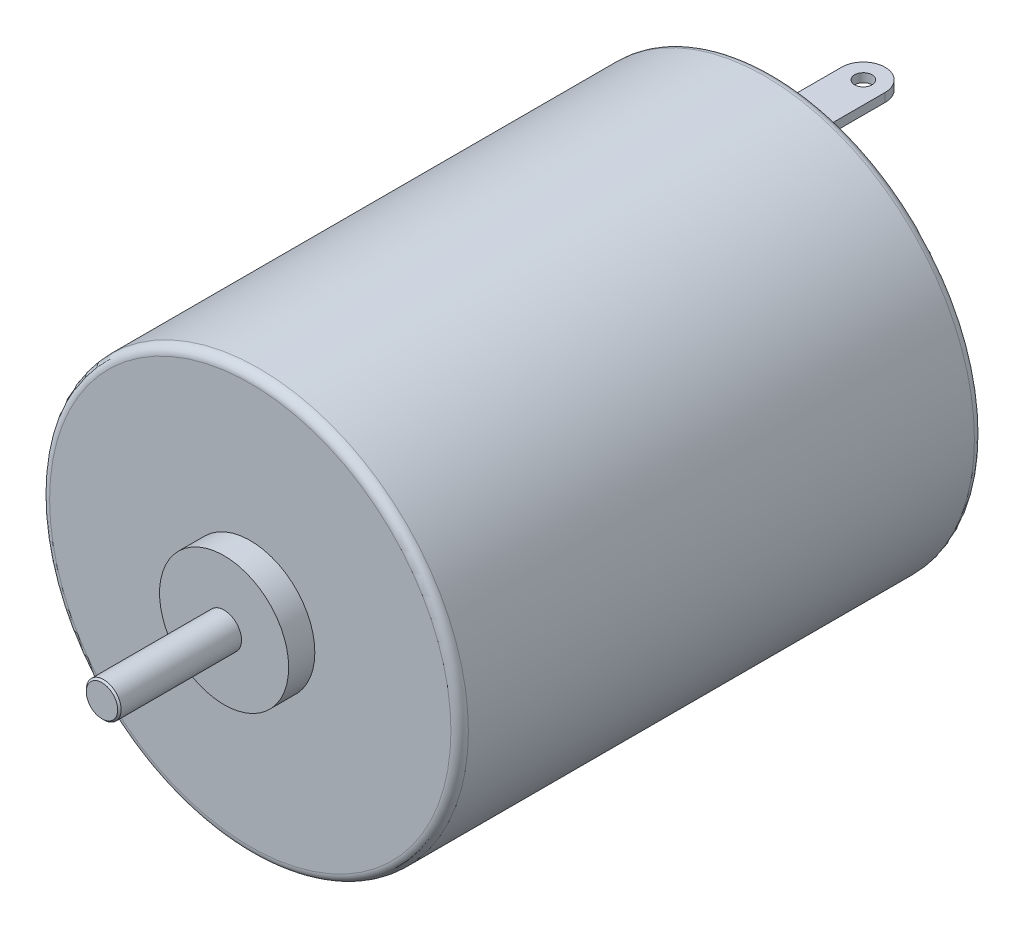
ISO-10303-21;
HEADER;
FILE_DESCRIPTION(('STEP AP214'),'2;1');
FILE_NAME('part.step','',(''),(''),'','','');
FILE_SCHEMA(('AUTOMOTIVE_DESIGN { 1 0 10303 214 1 1 1 1 }'));
ENDSEC;
DATA;
#1=APPLICATION_CONTEXT('core data for automotive mechanical design processes');
#2=APPLICATION_PROTOCOL_DEFINITION('international standard','automotive_design',2000,#1);
#3=PRODUCT_CONTEXT('',#1,'mechanical');
#4=PRODUCT('Part','Part','',(#3));
#5=PRODUCT_RELATED_PRODUCT_CATEGORY('part','',(#4));
#6=PRODUCT_DEFINITION_FORMATION('','',#4);
#7=PRODUCT_DEFINITION_CONTEXT('part definition',#1,'design');
#8=PRODUCT_DEFINITION('design','',#6,#7);
#9=PRODUCT_DEFINITION_SHAPE('','',#8);
#10=(LENGTH_UNIT() NAMED_UNIT(*) SI_UNIT(.MILLI.,.METRE.));
#11=(NAMED_UNIT(*) PLANE_ANGLE_UNIT() SI_UNIT($,.RADIAN.));
#12=(NAMED_UNIT(*) SI_UNIT($,.STERADIAN.) SOLID_ANGLE_UNIT());
#13=UNCERTAINTY_MEASURE_WITH_UNIT(LENGTH_MEASURE(1.E-05),#10,'distance_accuracy_value','');
#14=(GEOMETRIC_REPRESENTATION_CONTEXT(3) GLOBAL_UNCERTAINTY_ASSIGNED_CONTEXT((#13)) GLOBAL_UNIT_ASSIGNED_CONTEXT((#10,
#11,#12)) REPRESENTATION_CONTEXT('',''));
#15=CARTESIAN_POINT('',(0.,0.,0.));
#16=DIRECTION('',(0.,0.,1.));
#17=DIRECTION('',(1.,0.,0.));
#18=AXIS2_PLACEMENT_3D('',#15,#16,#17);
#19=CARTESIAN_POINT('',(0.,0.,0.));
#20=DIRECTION('',(0.,0.,1.));
#21=DIRECTION('',(1.,0.,0.));
#22=AXIS2_PLACEMENT_3D('',#19,#20,#21);
#23=PLANE('',#22);
#24=DIRECTION('',(1.,0.,0.));
#25=VECTOR('',#24,1.);
#26=CARTESIAN_POINT('',(1.25,8.5,0.));
#27=LINE('',#26,#25);
#28=CARTESIAN_POINT('',(-1.25,8.5,0.));
#29=VERTEX_POINT('',#28);
#30=CARTESIAN_POINT('',(1.25,8.5,0.));
#31=VERTEX_POINT('',#30);
#32=EDGE_CURVE('E514',#29,#31,#27,.T.);
#33=ORIENTED_EDGE('',*,*,#32,.T.);
#34=DIRECTION('',(0.,1.,0.));
#35=VECTOR('',#34,1.);
#36=CARTESIAN_POINT('',(1.25,8.5,0.));
#37=LINE('',#36,#35);
#38=CARTESIAN_POINT('',(1.25,9.,0.));
#39=VERTEX_POINT('',#38);
#40=EDGE_CURVE('E524',#31,#39,#37,.T.);
#41=ORIENTED_EDGE('',*,*,#40,.T.);
#42=DIRECTION('',(1.,0.,0.));
#43=VECTOR('',#42,1.);
#44=CARTESIAN_POINT('',(1.25,9.,0.));
#45=LINE('',#44,#43);
#46=CARTESIAN_POINT('',(-1.25,9.,0.));
#47=VERTEX_POINT('',#46);
#48=EDGE_CURVE('E503',#47,#39,#45,.T.);
#49=ORIENTED_EDGE('',*,*,#48,.F.);
#50=DIRECTION('',(0.,1.,0.));
#51=VECTOR('',#50,1.);
#52=CARTESIAN_POINT('',(-1.25,8.5,0.));
#53=LINE('',#52,#51);
#54=EDGE_CURVE('E527',#29,#47,#53,.T.);
#55=ORIENTED_EDGE('',*,*,#54,.F.);
#56=EDGE_LOOP('',(#33,#41,#49,#55));
#57=FACE_BOUND('',#56,.T.);
#58=CARTESIAN_POINT('',(0.,0.,0.));
#59=DIRECTION('',(0.,0.,1.));
#60=DIRECTION('',(1.,0.,0.));
#61=AXIS2_PLACEMENT_3D('',#58,#59,#60);
#62=CIRCLE('',#61,11.5);
#63=CARTESIAN_POINT('',(11.5,0.,0.));
#64=VERTEX_POINT('',#63);
#65=EDGE_CURVE('E573',#64,#64,#62,.F.);
#66=ORIENTED_EDGE('',*,*,#65,.T.);
#67=EDGE_LOOP('',(#66));
#68=FACE_BOUND('',#67,.T.);
#69=CARTESIAN_POINT('',(0.,0.,0.));
#70=DIRECTION('',(0.,0.,1.));
#71=DIRECTION('',(1.,0.,0.));
#72=AXIS2_PLACEMENT_3D('',#69,#70,#71);
#73=CIRCLE('',#72,4.25);
#74=CARTESIAN_POINT('',(3.5,-2.41091269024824,0.));
#75=VERTEX_POINT('',#74);
#76=CARTESIAN_POINT('',(-3.5,-2.41091269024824,0.));
#77=VERTEX_POINT('',#76);
#78=EDGE_CURVE('E583',#75,#77,#73,.F.);
#79=ORIENTED_EDGE('',*,*,#78,.F.);
#80=DIRECTION('',(0.,-1.,0.));
#81=VECTOR('',#80,1.);
#82=CARTESIAN_POINT('',(3.5,2.41091269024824,0.));
#83=LINE('',#82,#81);
#84=CARTESIAN_POINT('',(3.5,2.41091269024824,0.));
#85=VERTEX_POINT('',#84);
#86=EDGE_CURVE('E547',#85,#75,#83,.T.);
#87=ORIENTED_EDGE('',*,*,#86,.F.);
#88=CARTESIAN_POINT('',(-3.5,2.41091269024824,0.));
#89=VERTEX_POINT('',#88);
#90=EDGE_CURVE('E582',#89,#85,#73,.F.);
#91=ORIENTED_EDGE('',*,*,#90,.F.);
#92=DIRECTION('',(0.,1.,0.));
#93=VECTOR('',#92,1.);
#94=CARTESIAN_POINT('',(-3.5,2.41091269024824,0.));
#95=LINE('',#94,#93);
#96=EDGE_CURVE('E544',#77,#89,#95,.T.);
#97=ORIENTED_EDGE('',*,*,#96,.F.);
#98=EDGE_LOOP('',(#79,#87,#91,#97));
#99=FACE_BOUND('',#98,.T.);
#100=DIRECTION('',(1.,0.,0.));
#101=VECTOR('',#100,1.);
#102=CARTESIAN_POINT('',(1.25,-8.5,0.));
#103=LINE('',#102,#101);
#104=CARTESIAN_POINT('',(-1.25,-8.5,0.));
#105=VERTEX_POINT('',#104);
#106=CARTESIAN_POINT('',(1.25,-8.5,0.));
#107=VERTEX_POINT('',#106);
#108=EDGE_CURVE('E491',#105,#107,#103,.T.);
#109=ORIENTED_EDGE('',*,*,#108,.F.);
#110=DIRECTION('',(0.,-1.,0.));
#111=VECTOR('',#110,1.);
#112=CARTESIAN_POINT('',(-1.25,-8.5,0.));
#113=LINE('',#112,#111);
#114=CARTESIAN_POINT('',(-1.25,-9.,0.));
#115=VERTEX_POINT('',#114);
#116=EDGE_CURVE('E497',#105,#115,#113,.T.);
#117=ORIENTED_EDGE('',*,*,#116,.T.);
#118=DIRECTION('',(1.,0.,0.));
#119=VECTOR('',#118,1.);
#120=CARTESIAN_POINT('',(1.25,-9.,0.));
#121=LINE('',#120,#119);
#122=CARTESIAN_POINT('',(1.25,-9.,0.));
#123=VERTEX_POINT('',#122);
#124=EDGE_CURVE('E465',#115,#123,#121,.T.);
#125=ORIENTED_EDGE('',*,*,#124,.T.);
#126=DIRECTION('',(0.,-1.,0.));
#127=VECTOR('',#126,1.);
#128=CARTESIAN_POINT('',(1.25,-8.5,0.));
#129=LINE('',#128,#127);
#130=EDGE_CURVE('E463',#107,#123,#129,.T.);
#131=ORIENTED_EDGE('',*,*,#130,.F.);
#132=EDGE_LOOP('',(#109,#117,#125,#131));
#133=FACE_BOUND('',#132,.T.);
#134=ADVANCED_FACE('F350',(#57,#68,#99,#133),#23,.F.);
#135=CARTESIAN_POINT('',(0.,0.,-2.));
#136=DIRECTION('',(0.,0.,-1.));
#137=DIRECTION('',(-1.,0.,0.));
#138=AXIS2_PLACEMENT_3D('',#135,#136,#137);
#139=PLANE('',#138);
#140=CARTESIAN_POINT('',(0.,0.,-2.));
#141=DIRECTION('',(0.,0.,-1.));
#142=DIRECTION('',(-1.,0.,0.));
#143=AXIS2_PLACEMENT_3D('',#140,#141,#142);
#144=CIRCLE('',#143,4.05);
#145=CARTESIAN_POINT('',(3.5,-2.03776838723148,-2.));
#146=VERTEX_POINT('',#145);
#147=CARTESIAN_POINT('',(-3.5,-2.03776838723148,-2.));
#148=VERTEX_POINT('',#147);
#149=EDGE_CURVE('E586',#146,#148,#144,.T.);
#150=ORIENTED_EDGE('',*,*,#149,.T.);
#151=DIRECTION('',(0.,1.,0.));
#152=VECTOR('',#151,1.);
#153=CARTESIAN_POINT('',(-3.5,2.41091269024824,-2.));
#154=LINE('',#153,#152);
#155=CARTESIAN_POINT('',(-3.5,2.03776838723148,-2.));
#156=VERTEX_POINT('',#155);
#157=EDGE_CURVE('E536',#148,#156,#154,.T.);
#158=ORIENTED_EDGE('',*,*,#157,.T.);
#159=CARTESIAN_POINT('',(3.5,2.03776838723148,-2.));
#160=VERTEX_POINT('',#159);
#161=EDGE_CURVE('E587',#156,#160,#144,.T.);
#162=ORIENTED_EDGE('',*,*,#161,.T.);
#163=DIRECTION('',(0.,-1.,0.));
#164=VECTOR('',#163,1.);
#165=CARTESIAN_POINT('',(3.5,2.41091269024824,-2.));
#166=LINE('',#165,#164);
#167=EDGE_CURVE('E541',#160,#146,#166,.T.);
#168=ORIENTED_EDGE('',*,*,#167,.T.);
#169=EDGE_LOOP('',(#150,#158,#162,#168));
#170=FACE_BOUND('',#169,.T.);
#171=CARTESIAN_POINT('',(0.,0.,-2.));
#172=DIRECTION('',(0.,0.,-1.));
#173=DIRECTION('',(-1.,0.,0.));
#174=AXIS2_PLACEMENT_3D('',#171,#172,#173);
#175=CIRCLE('',#174,1.);
#176=CARTESIAN_POINT('',(-1.,0.,-2.));
#177=VERTEX_POINT('',#176);
#178=EDGE_CURVE('E523',#177,#177,#175,.T.);
#179=ORIENTED_EDGE('',*,*,#178,.F.);
#180=EDGE_LOOP('',(#179));
#181=FACE_BOUND('',#180,.T.);
#182=ADVANCED_FACE('F642',(#170,#181),#139,.T.);
#183=CARTESIAN_POINT('',(0.,0.,-2.));
#184=DIRECTION('',(0.,0.,1.));
#185=DIRECTION('',(1.,0.,0.));
#186=AXIS2_PLACEMENT_3D('',#183,#184,#185);
#187=CYLINDRICAL_SURFACE('',#186,4.25);
#188=DIRECTION('',(0.,0.,-1.));
#189=VECTOR('',#188,1.);
#190=CARTESIAN_POINT('',(-3.5,-2.41091269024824,999998.));
#191=LINE('',#190,#189);
#192=CARTESIAN_POINT('',(-3.5,-2.41091269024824,-1.80000000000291));
#193=VERTEX_POINT('',#192);
#194=EDGE_CURVE('E540',#77,#193,#191,.T.);
#195=ORIENTED_EDGE('',*,*,#194,.T.);
#196=CARTESIAN_POINT('',(0.,0.,-1.8));
#197=DIRECTION('',(0.,0.,-1.));
#198=DIRECTION('',(-1.,0.,0.));
#199=AXIS2_PLACEMENT_3D('',#196,#197,#198);
#200=CIRCLE('',#199,4.25);
#201=CARTESIAN_POINT('',(3.5,-2.41091269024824,-1.80000000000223));
#202=VERTEX_POINT('',#201);
#203=EDGE_CURVE('E591',#193,#202,#200,.F.);
#204=ORIENTED_EDGE('',*,*,#203,.T.);
#205=DIRECTION('',(0.,0.,-1.));
#206=VECTOR('',#205,1.);
#207=CARTESIAN_POINT('',(3.5,-2.41091269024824,999998.));
#208=LINE('',#207,#206);
#209=EDGE_CURVE('E539',#75,#202,#208,.T.);
#210=ORIENTED_EDGE('',*,*,#209,.F.);
#211=ORIENTED_EDGE('',*,*,#78,.T.);
#212=EDGE_LOOP('',(#195,#204,#210,#211));
#213=FACE_BOUND('',#212,.T.);
#214=ADVANCED_FACE('F637',(#213),#187,.T.);
#215=DIRECTION('',(0.,0.,-1.));
#216=VECTOR('',#215,1.);
#217=CARTESIAN_POINT('',(-3.5,2.41091269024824,999998.));
#218=LINE('',#217,#216);
#219=CARTESIAN_POINT('',(-3.5,2.41091269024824,-1.8));
#220=VERTEX_POINT('',#219);
#221=EDGE_CURVE('E535',#89,#220,#218,.T.);
#222=ORIENTED_EDGE('',*,*,#221,.F.);
#223=ORIENTED_EDGE('',*,*,#90,.T.);
#224=DIRECTION('',(0.,0.,-1.));
#225=VECTOR('',#224,1.);
#226=CARTESIAN_POINT('',(3.5,2.41091269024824,999998.));
#227=LINE('',#226,#225);
#228=CARTESIAN_POINT('',(3.5,2.41091269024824,-1.80000000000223));
#229=VERTEX_POINT('',#228);
#230=EDGE_CURVE('E545',#85,#229,#227,.T.);
#231=ORIENTED_EDGE('',*,*,#230,.T.);
#232=EDGE_CURVE('E590',#229,#220,#200,.F.);
#233=ORIENTED_EDGE('',*,*,#232,.T.);
#234=EDGE_LOOP('',(#222,#223,#231,#233));
#235=FACE_BOUND('',#234,.T.);
#236=ADVANCED_FACE('F646',(#235),#187,.T.);
#237=CARTESIAN_POINT('',(0.,0.,-2.));
#238=DIRECTION('',(0.,0.,1.));
#239=DIRECTION('',(1.,0.,0.));
#240=AXIS2_PLACEMENT_3D('',#237,#238,#239);
#241=CONICAL_SURFACE('',#240,4.05,0.785398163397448);
#242=ORIENTED_EDGE('',*,*,#203,.F.);
#243=CARTESIAN_POINT('',(-3.5,-5.19987886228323,0.218073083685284));
#244=CARTESIAN_POINT('',(-3.5,-5.06838337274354,0.109014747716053));
#245=CARTESIAN_POINT('',(-3.5,-4.93627461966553,0.000684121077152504));
#246=CARTESIAN_POINT('',(-3.5,-4.67050853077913,-0.214125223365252));
#247=CARTESIAN_POINT('',(-3.5,-4.53685082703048,-0.320603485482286));
#248=CARTESIAN_POINT('',(-3.5,-4.26677044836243,-0.532008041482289));
#249=CARTESIAN_POINT('',(-3.5,-4.13033486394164,-0.636917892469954));
#250=CARTESIAN_POINT('',(-3.5,-3.85525118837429,-0.843779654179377));
#251=CARTESIAN_POINT('',(-3.5,-3.71660329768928,-0.94573183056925));
#252=CARTESIAN_POINT('',(-3.5,-3.44223567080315,-1.14182791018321));
#253=CARTESIAN_POINT('',(-3.5,-3.30662291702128,-1.23612091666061));
#254=CARTESIAN_POINT('',(-3.5,-3.03238074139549,-1.42020567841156));
#255=CARTESIAN_POINT('',(-3.5,-2.89375166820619,-1.50999795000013));
#256=CARTESIAN_POINT('',(-3.5,-2.61312995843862,-1.68350188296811));
#257=CARTESIAN_POINT('',(-3.5,-2.47114528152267,-1.76722632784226));
#258=CARTESIAN_POINT('',(-3.5,-2.18286381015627,-1.92683525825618));
#259=CARTESIAN_POINT('',(-3.5,-2.03656904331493,-2.00272335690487));
#260=CARTESIAN_POINT('',(-3.5,-1.7579057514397,-2.13500574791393));
#261=CARTESIAN_POINT('',(-3.5,-1.62613641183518,-2.19265182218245));
#262=CARTESIAN_POINT('',(-3.5,-1.35862075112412,-2.29756662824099));
#263=CARTESIAN_POINT('',(-3.5,-1.22287960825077,-2.34484824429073));
#264=CARTESIAN_POINT('',(-3.5,-1.01526017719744,-2.40633610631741));
#265=CARTESIAN_POINT('',(-3.5,-0.944800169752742,-2.42537396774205));
#266=CARTESIAN_POINT('',(-3.5,-0.802981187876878,-2.45972896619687));
#267=CARTESIAN_POINT('',(-3.5,-0.731622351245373,-2.47504666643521));
#268=CARTESIAN_POINT('',(-3.5,-0.587796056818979,-2.50169109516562));
#269=CARTESIAN_POINT('',(-3.5,-0.515324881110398,-2.512997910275));
#270=CARTESIAN_POINT('',(-3.5,-0.369793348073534,-2.5312644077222));
#271=CARTESIAN_POINT('',(-3.5,-0.296732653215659,-2.5382213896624));
#272=CARTESIAN_POINT('',(-3.5,-0.223510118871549,-2.54287057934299));
#273=B_SPLINE_CURVE_WITH_KNOTS('',3,(#243,#244,#245,#246,#247,#248,#249,#250,#251,#252,#253,
#254,#255,#256,#257,#258,#259,#260,#261,#262,#263,#264,#265,#266,#267,#268,#269,#270,#271,#272),
.UNSPECIFIED.,.F.,.F.,(4,2,2,2,2,2,2,2,2,2,2,2,2,2,4),(0.,0.512515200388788,1.02515474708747,
1.54144345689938,2.05768564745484,2.55313515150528,3.04852768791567,3.54284423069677,
4.0369318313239,4.46809567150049,4.8987204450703,5.11759674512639,5.33643988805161,
5.55635482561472,5.77640615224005),.UNSPECIFIED.);
#274=EDGE_CURVE('E11',#193,#148,#273,.T.);
#275=ORIENTED_EDGE('',*,*,#274,.T.);
#276=ORIENTED_EDGE('',*,*,#149,.F.);
#277=CARTESIAN_POINT('',(3.5,-0.223510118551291,-2.5428705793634));
#278=CARTESIAN_POINT('',(3.5,-0.280283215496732,-2.53925730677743));
#279=CARTESIAN_POINT('',(3.5,-0.336957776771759,-2.53426703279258));
#280=CARTESIAN_POINT('',(3.5,-0.449996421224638,-2.52163636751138));
#281=CARTESIAN_POINT('',(3.5,-0.506360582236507,-2.51399667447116));
#282=CARTESIAN_POINT('',(3.5,-0.674627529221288,-2.48729248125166));
#283=CARTESIAN_POINT('',(3.5,-0.785942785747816,-2.46442689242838));
#284=CARTESIAN_POINT('',(3.5,-1.00508082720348,-2.41007903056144));
#285=CARTESIAN_POINT('',(3.5,-1.1129286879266,-2.37869543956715));
#286=CARTESIAN_POINT('',(3.5,-1.32619446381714,-2.30852358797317));
#287=CARTESIAN_POINT('',(3.5,-1.43161185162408,-2.26973373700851));
#288=CARTESIAN_POINT('',(3.5,-1.59517325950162,-2.20401248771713));
#289=CARTESIAN_POINT('',(3.5,-1.65416344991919,-2.17914909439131));
#290=CARTESIAN_POINT('',(3.5,-1.74212321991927,-2.14048627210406));
#291=CARTESIAN_POINT('',(3.5,-1.77138725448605,-2.12735560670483));
#292=CARTESIAN_POINT('',(3.5,-1.82971944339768,-2.10067072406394));
#293=CARTESIAN_POINT('',(3.5,-1.85878760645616,-2.087116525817));
#294=CARTESIAN_POINT('',(3.5,-2.0413591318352,-2.00045091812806));
#295=CARTESIAN_POINT('',(3.5,-2.19231683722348,-1.92192722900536));
#296=CARTESIAN_POINT('',(3.5,-2.4896643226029,-1.756615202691));
#297=CARTESIAN_POINT('',(3.5,-2.63605124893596,-1.6698218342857));
#298=CARTESIAN_POINT('',(3.5,-2.92542997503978,-1.48981612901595));
#299=CARTESIAN_POINT('',(3.5,-3.06840990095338,-1.39658480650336));
#300=CARTESIAN_POINT('',(3.5,-3.35116104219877,-1.2054737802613));
#301=CARTESIAN_POINT('',(3.5,-3.49093295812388,-1.1075951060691));
#302=CARTESIAN_POINT('',(3.5,-3.76468642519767,-0.910539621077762));
#303=CARTESIAN_POINT('',(3.5,-3.89872718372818,-0.811444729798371));
#304=CARTESIAN_POINT('',(3.5,-4.16477074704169,-0.610540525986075));
#305=CARTESIAN_POINT('',(3.5,-4.29677337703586,-0.508730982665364));
#306=CARTESIAN_POINT('',(3.5,-4.55809944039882,-0.30371957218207));
#307=CARTESIAN_POINT('',(3.5,-4.68743551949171,-0.200533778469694));
#308=CARTESIAN_POINT('',(3.5,-4.94466590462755,0.00756438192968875));
#309=CARTESIAN_POINT('',(3.5,-5.07256051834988,0.112476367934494));
#310=CARTESIAN_POINT('',(3.5,-5.19987886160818,0.218073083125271));
#311=B_SPLINE_CURVE_WITH_KNOTS('',3,(#277,#278,#279,#280,#281,#282,#283,#284,#285,#286,#287,
#288,#289,#290,#291,#292,#293,#294,#295,#296,#297,#298,#299,#300,#301,#302,#303,#304,#305,#306,
#307,#308,#309,#310),.UNSPECIFIED.,.F.,.F.,(4,2,2,2,2,2,2,2,2,2,2,2,2,2,2,2,4),(0.,
0.170627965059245,0.341210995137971,0.681664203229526,1.01833018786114,1.35506854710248,
1.54708938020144,1.64331036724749,1.73952704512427,2.2495878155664,2.75996090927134,
3.2719092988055,3.78374479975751,4.28378299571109,4.78386383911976,5.28021049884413,
5.77644912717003),.UNSPECIFIED.);
#312=EDGE_CURVE('E601',#146,#202,#311,.T.);
#313=ORIENTED_EDGE('',*,*,#312,.T.);
#314=EDGE_LOOP('',(#242,#275,#276,#313));
#315=FACE_BOUND('',#314,.T.);
#316=ADVANCED_FACE('F605',(#315),#241,.T.);
#317=ORIENTED_EDGE('',*,*,#161,.F.);
#318=CARTESIAN_POINT('',(-3.5,0.22351011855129,-2.5428705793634));
#319=CARTESIAN_POINT('',(-3.5,0.280283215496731,-2.53925730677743));
#320=CARTESIAN_POINT('',(-3.5,0.336957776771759,-2.53426703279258));
#321=CARTESIAN_POINT('',(-3.5,0.449996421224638,-2.52163636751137));
#322=CARTESIAN_POINT('',(-3.5,0.506360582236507,-2.51399667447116));
#323=CARTESIAN_POINT('',(-3.5,0.674627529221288,-2.48729248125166));
#324=CARTESIAN_POINT('',(-3.5,0.785942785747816,-2.46442689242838));
#325=CARTESIAN_POINT('',(-3.5,1.00508082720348,-2.41007903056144));
#326=CARTESIAN_POINT('',(-3.5,1.1129286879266,-2.37869543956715));
#327=CARTESIAN_POINT('',(-3.5,1.32619446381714,-2.30852358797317));
#328=CARTESIAN_POINT('',(-3.5,1.43161185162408,-2.26973373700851));
#329=CARTESIAN_POINT('',(-3.5,1.59517325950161,-2.20401248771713));
#330=CARTESIAN_POINT('',(-3.5,1.65416344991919,-2.17914909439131));
#331=CARTESIAN_POINT('',(-3.5,1.74212321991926,-2.14048627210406));
#332=CARTESIAN_POINT('',(-3.5,1.77138725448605,-2.12735560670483));
#333=CARTESIAN_POINT('',(-3.5,1.82971944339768,-2.10067072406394));
#334=CARTESIAN_POINT('',(-3.5,1.85878760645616,-2.087116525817));
#335=CARTESIAN_POINT('',(-3.5,2.0413591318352,-2.00045091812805));
#336=CARTESIAN_POINT('',(-3.5,2.19231683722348,-1.92192722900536));
#337=CARTESIAN_POINT('',(-3.5,2.48966432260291,-1.756615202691));
#338=CARTESIAN_POINT('',(-3.5,2.63605124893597,-1.6698218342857));
#339=CARTESIAN_POINT('',(-3.5,2.92542997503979,-1.48981612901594));
#340=CARTESIAN_POINT('',(-3.5,3.06840990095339,-1.39658480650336));
#341=CARTESIAN_POINT('',(-3.5,3.35116104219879,-1.20547378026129));
#342=CARTESIAN_POINT('',(-3.5,3.4909329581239,-1.10759510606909));
#343=CARTESIAN_POINT('',(-3.5,3.76468642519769,-0.910539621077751));
#344=CARTESIAN_POINT('',(-3.5,3.89872718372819,-0.811444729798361));
#345=CARTESIAN_POINT('',(-3.5,4.1647707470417,-0.610540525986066));
#346=CARTESIAN_POINT('',(-3.5,4.29677337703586,-0.508730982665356));
#347=CARTESIAN_POINT('',(-3.5,4.55809944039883,-0.303719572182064));
#348=CARTESIAN_POINT('',(-3.5,4.68743551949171,-0.200533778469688));
#349=CARTESIAN_POINT('',(-3.5,4.94466590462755,0.00756438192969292));
#350=CARTESIAN_POINT('',(-3.5,5.07256051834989,0.112476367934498));
#351=CARTESIAN_POINT('',(-3.5,5.19987886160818,0.218073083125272));
#352=B_SPLINE_CURVE_WITH_KNOTS('',3,(#318,#319,#320,#321,#322,#323,#324,#325,#326,#327,#328,
#329,#330,#331,#332,#333,#334,#335,#336,#337,#338,#339,#340,#341,#342,#343,#344,#345,#346,#347,
#348,#349,#350,#351),.UNSPECIFIED.,.F.,.F.,(4,2,2,2,2,2,2,2,2,2,2,2,2,2,2,2,4),(0.,
0.170627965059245,0.341210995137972,0.681664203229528,1.01833018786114,1.35506854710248,
1.54708938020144,1.64331036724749,1.73952704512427,2.24958781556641,2.75996090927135,
3.27190929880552,3.78374479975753,4.28378299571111,4.78386383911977,5.28021049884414,
5.77644912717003),.UNSPECIFIED.);
#353=EDGE_CURVE('E363',#156,#220,#352,.T.);
#354=ORIENTED_EDGE('',*,*,#353,.T.);
#355=ORIENTED_EDGE('',*,*,#232,.F.);
#356=CARTESIAN_POINT('',(3.5,5.19987886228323,0.218073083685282));
#357=CARTESIAN_POINT('',(3.5,5.06838337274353,0.109014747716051));
#358=CARTESIAN_POINT('',(3.5,4.93627461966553,0.000684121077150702));
#359=CARTESIAN_POINT('',(3.5,4.67050853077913,-0.214125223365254));
#360=CARTESIAN_POINT('',(3.5,4.53685082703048,-0.320603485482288));
#361=CARTESIAN_POINT('',(3.5,4.26677044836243,-0.532008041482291));
#362=CARTESIAN_POINT('',(3.5,4.13033486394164,-0.636917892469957));
#363=CARTESIAN_POINT('',(3.5,3.85525118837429,-0.843779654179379));
#364=CARTESIAN_POINT('',(3.5,3.71660329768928,-0.945731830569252));
#365=CARTESIAN_POINT('',(3.5,3.44223567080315,-1.14182791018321));
#366=CARTESIAN_POINT('',(3.5,3.30662291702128,-1.23612091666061));
#367=CARTESIAN_POINT('',(3.5,3.03238074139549,-1.42020567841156));
#368=CARTESIAN_POINT('',(3.5,2.89375166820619,-1.50999795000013));
#369=CARTESIAN_POINT('',(3.5,2.61312995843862,-1.68350188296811));
#370=CARTESIAN_POINT('',(3.5,2.47114528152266,-1.76722632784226));
#371=CARTESIAN_POINT('',(3.5,2.18286381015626,-1.92683525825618));
#372=CARTESIAN_POINT('',(3.5,2.03656904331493,-2.00272335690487));
#373=CARTESIAN_POINT('',(3.5,1.7579057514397,-2.13500574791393));
#374=CARTESIAN_POINT('',(3.5,1.62613641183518,-2.19265182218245));
#375=CARTESIAN_POINT('',(3.5,1.35862075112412,-2.29756662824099));
#376=CARTESIAN_POINT('',(3.5,1.22287960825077,-2.34484824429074));
#377=CARTESIAN_POINT('',(3.5,1.01526017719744,-2.40633610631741));
#378=CARTESIAN_POINT('',(3.5,0.944800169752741,-2.42537396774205));
#379=CARTESIAN_POINT('',(3.5,0.802981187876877,-2.45972896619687));
#380=CARTESIAN_POINT('',(3.5,0.731622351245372,-2.47504666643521));
#381=CARTESIAN_POINT('',(3.5,0.587796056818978,-2.50169109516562));
#382=CARTESIAN_POINT('',(3.5,0.515324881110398,-2.512997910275));
#383=CARTESIAN_POINT('',(3.5,0.369793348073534,-2.53126440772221));
#384=CARTESIAN_POINT('',(3.5,0.296732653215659,-2.53822138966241));
#385=CARTESIAN_POINT('',(3.5,0.223510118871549,-2.54287057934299));
#386=B_SPLINE_CURVE_WITH_KNOTS('',3,(#356,#357,#358,#359,#360,#361,#362,#363,#364,#365,#366,
#367,#368,#369,#370,#371,#372,#373,#374,#375,#376,#377,#378,#379,#380,#381,#382,#383,#384,#385),
.UNSPECIFIED.,.F.,.F.,(4,2,2,2,2,2,2,2,2,2,2,2,2,2,4),(0.,0.512515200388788,1.02515474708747,
1.54144345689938,2.05768564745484,2.55313515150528,3.04852768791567,3.54284423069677,
4.0369318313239,4.46809567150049,4.8987204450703,5.11759674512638,5.33643988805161,
5.55635482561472,5.77640615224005),.UNSPECIFIED.);
#387=EDGE_CURVE('E594',#229,#160,#386,.T.);
#388=ORIENTED_EDGE('',*,*,#387,.T.);
#389=EDGE_LOOP('',(#317,#354,#355,#388));
#390=FACE_BOUND('',#389,.T.);
#391=ADVANCED_FACE('F644',(#390),#241,.T.);
#392=CARTESIAN_POINT('',(0.,0.,31.5));
#393=DIRECTION('',(0.,0.,1.));
#394=DIRECTION('',(1.,0.,0.));
#395=AXIS2_PLACEMENT_3D('',#392,#393,#394);
#396=PLANE('',#395);
#397=CARTESIAN_POINT('',(0.,0.,31.5));
#398=DIRECTION('',(0.,0.,1.));
#399=DIRECTION('',(1.,0.,0.));
#400=AXIS2_PLACEMENT_3D('',#397,#398,#399);
#401=CIRCLE('',#400,3.70031111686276);
#402=CARTESIAN_POINT('',(3.70031111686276,0.,31.5));
#403=VERTEX_POINT('',#402);
#404=EDGE_CURVE('E561',#403,#403,#401,.T.);
#405=ORIENTED_EDGE('',*,*,#404,.T.);
#406=EDGE_LOOP('',(#405));
#407=FACE_BOUND('',#406,.T.);
#408=CARTESIAN_POINT('',(0.,0.,31.5));
#409=DIRECTION('',(0.,0.,1.));
#410=DIRECTION('',(1.,0.,0.));
#411=AXIS2_PLACEMENT_3D('',#408,#409,#410);
#412=CIRCLE('',#411,1.);
#413=CARTESIAN_POINT('',(1.,0.,31.5));
#414=VERTEX_POINT('',#413);
#415=EDGE_CURVE('E549',#414,#414,#412,.T.);
#416=ORIENTED_EDGE('',*,*,#415,.F.);
#417=EDGE_LOOP('',(#416));
#418=FACE_BOUND('',#417,.T.);
#419=ADVANCED_FACE('F719',(#407,#418),#396,.T.);
#420=CARTESIAN_POINT('',(0.,0.,30.));
#421=DIRECTION('',(0.,0.,1.));
#422=DIRECTION('',(1.,0.,0.));
#423=AXIS2_PLACEMENT_3D('',#420,#421,#422);
#424=PLANE('',#423);
#425=CARTESIAN_POINT('',(0.,0.,30.));
#426=DIRECTION('',(0.,0.,1.));
#427=DIRECTION('',(1.,0.,0.));
#428=AXIS2_PLACEMENT_3D('',#425,#426,#427);
#429=CIRCLE('',#428,11.5);
#430=CARTESIAN_POINT('',(11.5,0.,30.));
#431=VERTEX_POINT('',#430);
#432=EDGE_CURVE('E564',#431,#431,#429,.T.);
#433=ORIENTED_EDGE('',*,*,#432,.T.);
#434=EDGE_LOOP('',(#433));
#435=FACE_BOUND('',#434,.T.);
#436=CARTESIAN_POINT('',(0.,0.,30.));
#437=DIRECTION('',(0.,0.,1.));
#438=DIRECTION('',(1.,0.,0.));
#439=AXIS2_PLACEMENT_3D('',#436,#437,#438);
#440=CIRCLE('',#439,3.70031111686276);
#441=CARTESIAN_POINT('',(3.70031111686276,0.,30.));
#442=VERTEX_POINT('',#441);
#443=EDGE_CURVE('E558',#442,#442,#440,.T.);
#444=ORIENTED_EDGE('',*,*,#443,.F.);
#445=EDGE_LOOP('',(#444));
#446=FACE_BOUND('',#445,.T.);
#447=ADVANCED_FACE('F722',(#435,#446),#424,.T.);
#448=CARTESIAN_POINT('',(0.,0.,30.));
#449=DIRECTION('',(0.,0.,-1.));
#450=DIRECTION('',(-1.,0.,0.));
#451=AXIS2_PLACEMENT_3D('',#448,#449,#450);
#452=CYLINDRICAL_SURFACE('',#451,12.);
#453=CARTESIAN_POINT('',(0.,0.,29.5));
#454=DIRECTION('',(0.,0.,1.));
#455=DIRECTION('',(1.,0.,0.));
#456=AXIS2_PLACEMENT_3D('',#453,#454,#455);
#457=CIRCLE('',#456,12.);
#458=CARTESIAN_POINT('',(12.,0.,29.5));
#459=VERTEX_POINT('',#458);
#460=EDGE_CURVE('E570',#459,#459,#457,.F.);
#461=ORIENTED_EDGE('',*,*,#460,.T.);
#462=EDGE_LOOP('',(#461));
#463=FACE_BOUND('',#462,.T.);
#464=CARTESIAN_POINT('',(0.,0.,0.5));
#465=DIRECTION('',(0.,0.,1.));
#466=DIRECTION('',(1.,0.,0.));
#467=AXIS2_PLACEMENT_3D('',#464,#465,#466);
#468=CIRCLE('',#467,12.);
#469=CARTESIAN_POINT('',(12.,0.,0.5));
#470=VERTEX_POINT('',#469);
#471=EDGE_CURVE('E567',#470,#470,#468,.T.);
#472=ORIENTED_EDGE('',*,*,#471,.T.);
#473=EDGE_LOOP('',(#472));
#474=FACE_BOUND('',#473,.T.);
#475=ADVANCED_FACE('F352',(#463,#474),#452,.T.);
#476=CARTESIAN_POINT('',(0.,0.,29.5));
#477=DIRECTION('',(0.,0.,1.));
#478=DIRECTION('',(1.,0.,0.));
#479=AXIS2_PLACEMENT_3D('',#476,#477,#478);
#480=TOROIDAL_SURFACE('',#479,11.5,0.5);
#481=ORIENTED_EDGE('',*,*,#460,.F.);
#482=EDGE_LOOP('',(#481));
#483=FACE_BOUND('',#482,.T.);
#484=ORIENTED_EDGE('',*,*,#432,.F.);
#485=EDGE_LOOP('',(#484));
#486=FACE_BOUND('',#485,.T.);
#487=ADVANCED_FACE('F730',(#483,#486),#480,.T.);
#488=CARTESIAN_POINT('',(0.,0.,0.5));
#489=DIRECTION('',(0.,0.,1.));
#490=DIRECTION('',(1.,0.,0.));
#491=AXIS2_PLACEMENT_3D('',#488,#489,#490);
#492=TOROIDAL_SURFACE('',#491,11.5,0.5);
#493=ORIENTED_EDGE('',*,*,#65,.F.);
#494=EDGE_LOOP('',(#493));
#495=FACE_BOUND('',#494,.T.);
#496=ORIENTED_EDGE('',*,*,#471,.F.);
#497=EDGE_LOOP('',(#496));
#498=FACE_BOUND('',#497,.T.);
#499=ADVANCED_FACE('F726',(#495,#498),#492,.T.);
#500=CARTESIAN_POINT('',(0.,0.,31.5));
#501=DIRECTION('',(0.,0.,-1.));
#502=DIRECTION('',(-1.,0.,0.));
#503=AXIS2_PLACEMENT_3D('',#500,#501,#502);
#504=CYLINDRICAL_SURFACE('',#503,3.70031111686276);
#505=ORIENTED_EDGE('',*,*,#404,.F.);
#506=EDGE_LOOP('',(#505));
#507=FACE_BOUND('',#506,.T.);
#508=ORIENTED_EDGE('',*,*,#443,.T.);
#509=EDGE_LOOP('',(#508));
#510=FACE_BOUND('',#509,.T.);
#511=ADVANCED_FACE('F717',(#507,#510),#504,.T.);
#512=CARTESIAN_POINT('',(0.,0.,38.5));
#513=DIRECTION('',(0.,0.,-1.));
#514=DIRECTION('',(-1.,0.,0.));
#515=AXIS2_PLACEMENT_3D('',#512,#513,#514);
#516=CYLINDRICAL_SURFACE('',#515,1.);
#517=CARTESIAN_POINT('',(0.,0.,38.4));
#518=DIRECTION('',(0.,0.,1.));
#519=DIRECTION('',(1.,0.,0.));
#520=AXIS2_PLACEMENT_3D('',#517,#518,#519);
#521=CIRCLE('',#520,1.);
#522=CARTESIAN_POINT('',(1.,0.,38.4));
#523=VERTEX_POINT('',#522);
#524=EDGE_CURVE('E579',#523,#523,#521,.F.);
#525=ORIENTED_EDGE('',*,*,#524,.T.);
#526=EDGE_LOOP('',(#525));
#527=FACE_BOUND('',#526,.T.);
#528=ORIENTED_EDGE('',*,*,#415,.T.);
#529=EDGE_LOOP('',(#528));
#530=FACE_BOUND('',#529,.T.);
#531=ADVANCED_FACE('F713',(#527,#530),#516,.T.);
#532=CARTESIAN_POINT('',(0.,0.,38.5));
#533=DIRECTION('',(0.,0.,1.));
#534=DIRECTION('',(1.,0.,0.));
#535=AXIS2_PLACEMENT_3D('',#532,#533,#534);
#536=PLANE('',#535);
#537=CARTESIAN_POINT('',(0.,0.,38.5));
#538=DIRECTION('',(0.,0.,1.));
#539=DIRECTION('',(1.,0.,0.));
#540=AXIS2_PLACEMENT_3D('',#537,#538,#539);
#541=CIRCLE('',#540,0.899999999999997);
#542=CARTESIAN_POINT('',(0.899999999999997,0.,38.5));
#543=VERTEX_POINT('',#542);
#544=EDGE_CURVE('E576',#543,#543,#541,.T.);
#545=ORIENTED_EDGE('',*,*,#544,.T.);
#546=EDGE_LOOP('',(#545));
#547=FACE_BOUND('',#546,.T.);
#548=ADVANCED_FACE('F709',(#547),#536,.T.);
#549=CARTESIAN_POINT('',(0.,0.,38.5));
#550=DIRECTION('',(0.,0.,-1.));
#551=DIRECTION('',(-1.,0.,0.));
#552=AXIS2_PLACEMENT_3D('',#549,#550,#551);
#553=CONICAL_SURFACE('',#552,0.899999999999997,0.785398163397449);
#554=ORIENTED_EDGE('',*,*,#524,.F.);
#555=EDGE_LOOP('',(#554));
#556=FACE_BOUND('',#555,.T.);
#557=ORIENTED_EDGE('',*,*,#544,.F.);
#558=EDGE_LOOP('',(#557));
#559=FACE_BOUND('',#558,.T.);
#560=ADVANCED_FACE('F613',(#556,#559),#553,.T.);
#561=CARTESIAN_POINT('',(3.5,2.41091269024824,999998.));
#562=DIRECTION('',(1.,0.,0.));
#563=DIRECTION('',(0.,1.,0.));
#564=AXIS2_PLACEMENT_3D('',#561,#562,#563);
#565=PLANE('',#564);
#566=ORIENTED_EDGE('',*,*,#167,.F.);
#567=ORIENTED_EDGE('',*,*,#387,.F.);
#568=ORIENTED_EDGE('',*,*,#230,.F.);
#569=ORIENTED_EDGE('',*,*,#86,.T.);
#570=ORIENTED_EDGE('',*,*,#209,.T.);
#571=ORIENTED_EDGE('',*,*,#312,.F.);
#572=EDGE_LOOP('',(#566,#567,#568,#569,#570,#571));
#573=FACE_BOUND('',#572,.T.);
#574=ADVANCED_FACE('F608',(#573),#565,.T.);
#575=CARTESIAN_POINT('',(-3.5,2.41091269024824,999998.));
#576=DIRECTION('',(-1.,0.,0.));
#577=DIRECTION('',(0.,-1.,0.));
#578=AXIS2_PLACEMENT_3D('',#575,#576,#577);
#579=PLANE('',#578);
#580=ORIENTED_EDGE('',*,*,#194,.F.);
#581=ORIENTED_EDGE('',*,*,#96,.T.);
#582=ORIENTED_EDGE('',*,*,#221,.T.);
#583=ORIENTED_EDGE('',*,*,#353,.F.);
#584=ORIENTED_EDGE('',*,*,#157,.F.);
#585=ORIENTED_EDGE('',*,*,#274,.F.);
#586=EDGE_LOOP('',(#580,#581,#582,#583,#584,#585));
#587=FACE_BOUND('',#586,.T.);
#588=ADVANCED_FACE('F612',(#587),#579,.T.);
#589=CARTESIAN_POINT('',(0.,0.,-3.));
#590=DIRECTION('',(0.,0.,1.));
#591=DIRECTION('',(1.,0.,0.));
#592=AXIS2_PLACEMENT_3D('',#589,#590,#591);
#593=CYLINDRICAL_SURFACE('',#592,1.);
#594=CARTESIAN_POINT('',(0.,0.,-3.));
#595=DIRECTION('',(0.,0.,-1.));
#596=DIRECTION('',(-1.,0.,0.));
#597=AXIS2_PLACEMENT_3D('',#594,#595,#596);
#598=CIRCLE('',#597,1.);
#599=CARTESIAN_POINT('',(-1.,0.,-3.));
#600=VERTEX_POINT('',#599);
#601=EDGE_CURVE('E532',#600,#600,#598,.T.);
#602=ORIENTED_EDGE('',*,*,#601,.F.);
#603=EDGE_LOOP('',(#602));
#604=FACE_BOUND('',#603,.T.);
#605=ORIENTED_EDGE('',*,*,#178,.T.);
#606=EDGE_LOOP('',(#605));
#607=FACE_BOUND('',#606,.T.);
#608=ADVANCED_FACE('F615',(#604,#607),#593,.T.);
#609=CARTESIAN_POINT('',(0.,0.,-3.));
#610=DIRECTION('',(0.,0.,-1.));
#611=DIRECTION('',(-1.,0.,0.));
#612=AXIS2_PLACEMENT_3D('',#609,#610,#611);
#613=PLANE('',#612);
#614=ORIENTED_EDGE('',*,*,#601,.T.);
#615=EDGE_LOOP('',(#614));
#616=FACE_BOUND('',#615,.T.);
#617=ADVANCED_FACE('F690',(#616),#613,.T.);
#618=CARTESIAN_POINT('',(0.,8.5,-5.13587767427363));
#619=DIRECTION('',(0.,1.,0.));
#620=DIRECTION('',(0.,0.,1.));
#621=AXIS2_PLACEMENT_3D('',#618,#619,#620);
#622=CYLINDRICAL_SURFACE('',#621,1.25);
#623=CARTESIAN_POINT('',(0.,9.,-5.13587767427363));
#624=DIRECTION('',(0.,1.,0.));
#625=DIRECTION('',(0.,0.,1.));
#626=AXIS2_PLACEMENT_3D('',#623,#624,#625);
#627=CIRCLE('',#626,1.25);
#628=CARTESIAN_POINT('',(1.25,9.,-5.13587767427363));
#629=VERTEX_POINT('',#628);
#630=CARTESIAN_POINT('',(-1.25,9.,-5.13587767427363));
#631=VERTEX_POINT('',#630);
#632=EDGE_CURVE('E496',#629,#631,#627,.T.);
#633=ORIENTED_EDGE('',*,*,#632,.F.);
#634=DIRECTION('',(0.,1.,0.));
#635=VECTOR('',#634,1.);
#636=CARTESIAN_POINT('',(1.25,8.5,-5.13587767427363));
#637=LINE('',#636,#635);
#638=CARTESIAN_POINT('',(1.25,8.5,-5.13587767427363));
#639=VERTEX_POINT('',#638);
#640=EDGE_CURVE('E521',#639,#629,#637,.T.);
#641=ORIENTED_EDGE('',*,*,#640,.F.);
#642=CARTESIAN_POINT('',(0.,8.5,-5.13587767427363));
#643=DIRECTION('',(0.,1.,0.));
#644=DIRECTION('',(0.,0.,1.));
#645=AXIS2_PLACEMENT_3D('',#642,#643,#644);
#646=CIRCLE('',#645,1.25);
#647=CARTESIAN_POINT('',(-1.25,8.5,-5.13587767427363));
#648=VERTEX_POINT('',#647);
#649=EDGE_CURVE('E508',#639,#648,#646,.T.);
#650=ORIENTED_EDGE('',*,*,#649,.T.);
#651=DIRECTION('',(0.,1.,0.));
#652=VECTOR('',#651,1.);
#653=CARTESIAN_POINT('',(-1.25,8.5,-5.13587767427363));
#654=LINE('',#653,#652);
#655=EDGE_CURVE('E520',#648,#631,#654,.T.);
#656=ORIENTED_EDGE('',*,*,#655,.T.);
#657=EDGE_LOOP('',(#633,#641,#650,#656));
#658=FACE_BOUND('',#657,.T.);
#659=ADVANCED_FACE('F684',(#658),#622,.T.);
#660=CARTESIAN_POINT('',(1.25,8.5,-5.13587767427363));
#661=DIRECTION('',(1.,0.,0.));
#662=DIRECTION('',(0.,0.,-1.));
#663=AXIS2_PLACEMENT_3D('',#660,#661,#662);
#664=PLANE('',#663);
#665=DIRECTION('',(0.,0.,-1.));
#666=VECTOR('',#665,1.);
#667=CARTESIAN_POINT('',(1.25,9.,-5.13587767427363));
#668=LINE('',#667,#666);
#669=EDGE_CURVE('E505',#39,#629,#668,.T.);
#670=ORIENTED_EDGE('',*,*,#669,.F.);
#671=ORIENTED_EDGE('',*,*,#40,.F.);
#672=DIRECTION('',(0.,0.,-1.));
#673=VECTOR('',#672,1.);
#674=CARTESIAN_POINT('',(1.25,8.5,-5.13587767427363));
#675=LINE('',#674,#673);
#676=EDGE_CURVE('E517',#31,#639,#675,.T.);
#677=ORIENTED_EDGE('',*,*,#676,.T.);
#678=ORIENTED_EDGE('',*,*,#640,.T.);
#679=EDGE_LOOP('',(#670,#671,#677,#678));
#680=FACE_BOUND('',#679,.T.);
#681=ADVANCED_FACE('F681',(#680),#664,.T.);
#682=CARTESIAN_POINT('',(-1.25,8.5,-5.13587767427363));
#683=DIRECTION('',(-1.,0.,0.));
#684=DIRECTION('',(0.,0.,1.));
#685=AXIS2_PLACEMENT_3D('',#682,#683,#684);
#686=PLANE('',#685);
#687=DIRECTION('',(0.,0.,1.));
#688=VECTOR('',#687,1.);
#689=CARTESIAN_POINT('',(-1.25,9.,-5.13587767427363));
#690=LINE('',#689,#688);
#691=EDGE_CURVE('E378',#631,#47,#690,.T.);
#692=ORIENTED_EDGE('',*,*,#691,.F.);
#693=ORIENTED_EDGE('',*,*,#655,.F.);
#694=DIRECTION('',(0.,0.,1.));
#695=VECTOR('',#694,1.);
#696=CARTESIAN_POINT('',(-1.25,8.5,-5.13587767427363));
#697=LINE('',#696,#695);
#698=EDGE_CURVE('E511',#648,#29,#697,.T.);
#699=ORIENTED_EDGE('',*,*,#698,.T.);
#700=ORIENTED_EDGE('',*,*,#54,.T.);
#701=EDGE_LOOP('',(#692,#693,#699,#700));
#702=FACE_BOUND('',#701,.T.);
#703=ADVANCED_FACE('F679',(#702),#686,.T.);
#704=CARTESIAN_POINT('',(0.,8.5,-5.13587767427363));
#705=DIRECTION('',(0.,1.,0.));
#706=DIRECTION('',(0.,0.,1.));
#707=AXIS2_PLACEMENT_3D('',#704,#705,#706);
#708=PLANE('',#707);
#709=CARTESIAN_POINT('',(0.,8.5,-5.13587767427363));
#710=DIRECTION('',(0.,1.,0.));
#711=DIRECTION('',(0.,0.,1.));
#712=AXIS2_PLACEMENT_3D('',#709,#710,#711);
#713=CIRCLE('',#712,0.5);
#714=CARTESIAN_POINT('',(0.,8.5,-4.63587767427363));
#715=VERTEX_POINT('',#714);
#716=EDGE_CURVE('E479',#715,#715,#713,.T.);
#717=ORIENTED_EDGE('',*,*,#716,.T.);
#718=EDGE_LOOP('',(#717));
#719=FACE_BOUND('',#718,.T.);
#720=ORIENTED_EDGE('',*,*,#649,.F.);
#721=ORIENTED_EDGE('',*,*,#676,.F.);
#722=ORIENTED_EDGE('',*,*,#32,.F.);
#723=ORIENTED_EDGE('',*,*,#698,.F.);
#724=EDGE_LOOP('',(#720,#721,#722,#723));
#725=FACE_BOUND('',#724,.T.);
#726=ADVANCED_FACE('F675',(#719,#725),#708,.F.);
#727=CARTESIAN_POINT('',(0.,9.,-5.13587767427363));
#728=DIRECTION('',(0.,1.,0.));
#729=DIRECTION('',(0.,0.,1.));
#730=AXIS2_PLACEMENT_3D('',#727,#728,#729);
#731=PLANE('',#730);
#732=CARTESIAN_POINT('',(0.,9.,-5.13587767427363));
#733=DIRECTION('',(0.,1.,0.));
#734=DIRECTION('',(0.,0.,1.));
#735=AXIS2_PLACEMENT_3D('',#732,#733,#734);
#736=CIRCLE('',#735,0.5);
#737=CARTESIAN_POINT('',(0.,9.,-4.63587767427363));
#738=VERTEX_POINT('',#737);
#739=EDGE_CURVE('E482',#738,#738,#736,.T.);
#740=ORIENTED_EDGE('',*,*,#739,.F.);
#741=EDGE_LOOP('',(#740));
#742=FACE_BOUND('',#741,.T.);
#743=ORIENTED_EDGE('',*,*,#632,.T.);
#744=ORIENTED_EDGE('',*,*,#691,.T.);
#745=ORIENTED_EDGE('',*,*,#48,.T.);
#746=ORIENTED_EDGE('',*,*,#669,.T.);
#747=EDGE_LOOP('',(#743,#744,#745,#746));
#748=FACE_BOUND('',#747,.T.);
#749=ADVANCED_FACE('F668',(#742,#748),#731,.T.);
#750=CARTESIAN_POINT('',(0.,-8.5,-5.13587767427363));
#751=DIRECTION('',(0.,-1.,0.));
#752=DIRECTION('',(0.,0.,-1.));
#753=AXIS2_PLACEMENT_3D('',#750,#751,#752);
#754=CYLINDRICAL_SURFACE('',#753,1.25);
#755=CARTESIAN_POINT('',(0.,-9.,-5.13587767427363));
#756=DIRECTION('',(0.,1.,0.));
#757=DIRECTION('',(0.,0.,1.));
#758=AXIS2_PLACEMENT_3D('',#755,#756,#757);
#759=CIRCLE('',#758,1.25);
#760=CARTESIAN_POINT('',(1.25,-9.,-5.13587767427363));
#761=VERTEX_POINT('',#760);
#762=CARTESIAN_POINT('',(-1.25,-9.,-5.13587767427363));
#763=VERTEX_POINT('',#762);
#764=EDGE_CURVE('E466',#761,#763,#759,.T.);
#765=ORIENTED_EDGE('',*,*,#764,.T.);
#766=DIRECTION('',(0.,-1.,0.));
#767=VECTOR('',#766,1.);
#768=CARTESIAN_POINT('',(-1.25,-8.5,-5.13587767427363));
#769=LINE('',#768,#767);
#770=CARTESIAN_POINT('',(-1.25,-8.5,-5.13587767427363));
#771=VERTEX_POINT('',#770);
#772=EDGE_CURVE('E494',#771,#763,#769,.T.);
#773=ORIENTED_EDGE('',*,*,#772,.F.);
#774=CARTESIAN_POINT('',(0.,-8.5,-5.13587767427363));
#775=DIRECTION('',(0.,1.,0.));
#776=DIRECTION('',(0.,0.,1.));
#777=AXIS2_PLACEMENT_3D('',#774,#775,#776);
#778=CIRCLE('',#777,1.25);
#779=CARTESIAN_POINT('',(1.25,-8.5,-5.13587767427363));
#780=VERTEX_POINT('',#779);
#781=EDGE_CURVE('E473',#780,#771,#778,.T.);
#782=ORIENTED_EDGE('',*,*,#781,.F.);
#783=DIRECTION('',(0.,-1.,0.));
#784=VECTOR('',#783,1.);
#785=CARTESIAN_POINT('',(1.25,-8.5,-5.13587767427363));
#786=LINE('',#785,#784);
#787=EDGE_CURVE('E460',#780,#761,#786,.T.);
#788=ORIENTED_EDGE('',*,*,#787,.T.);
#789=EDGE_LOOP('',(#765,#773,#782,#788));
#790=FACE_BOUND('',#789,.T.);
#791=ADVANCED_FACE('F470',(#790),#754,.T.);
#792=CARTESIAN_POINT('',(-1.25,-8.5,-5.13587767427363));
#793=DIRECTION('',(1.,0.,0.));
#794=DIRECTION('',(0.,0.,-1.));
#795=AXIS2_PLACEMENT_3D('',#792,#793,#794);
#796=PLANE('',#795);
#797=DIRECTION('',(0.,0.,1.));
#798=VECTOR('',#797,1.);
#799=CARTESIAN_POINT('',(-1.25,-9.,-5.13587767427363));
#800=LINE('',#799,#798);
#801=EDGE_CURVE('E477',#763,#115,#800,.T.);
#802=ORIENTED_EDGE('',*,*,#801,.T.);
#803=ORIENTED_EDGE('',*,*,#116,.F.);
#804=DIRECTION('',(0.,0.,1.));
#805=VECTOR('',#804,1.);
#806=CARTESIAN_POINT('',(-1.25,-8.5,-5.13587767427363));
#807=LINE('',#806,#805);
#808=EDGE_CURVE('E474',#771,#105,#807,.T.);
#809=ORIENTED_EDGE('',*,*,#808,.F.);
#810=ORIENTED_EDGE('',*,*,#772,.T.);
#811=EDGE_LOOP('',(#802,#803,#809,#810));
#812=FACE_BOUND('',#811,.T.);
#813=ADVANCED_FACE('F660',(#812),#796,.F.);
#814=CARTESIAN_POINT('',(1.25,-8.5,-5.13587767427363));
#815=DIRECTION('',(-1.,0.,0.));
#816=DIRECTION('',(0.,0.,1.));
#817=AXIS2_PLACEMENT_3D('',#814,#815,#816);
#818=PLANE('',#817);
#819=DIRECTION('',(0.,0.,-1.));
#820=VECTOR('',#819,1.);
#821=CARTESIAN_POINT('',(1.25,-9.,-5.13587767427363));
#822=LINE('',#821,#820);
#823=EDGE_CURVE('E370',#123,#761,#822,.T.);
#824=ORIENTED_EDGE('',*,*,#823,.T.);
#825=ORIENTED_EDGE('',*,*,#787,.F.);
#826=DIRECTION('',(0.,0.,-1.));
#827=VECTOR('',#826,1.);
#828=CARTESIAN_POINT('',(1.25,-8.5,-5.13587767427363));
#829=LINE('',#828,#827);
#830=EDGE_CURVE('E489',#107,#780,#829,.T.);
#831=ORIENTED_EDGE('',*,*,#830,.F.);
#832=ORIENTED_EDGE('',*,*,#130,.T.);
#833=EDGE_LOOP('',(#824,#825,#831,#832));
#834=FACE_BOUND('',#833,.T.);
#835=ADVANCED_FACE('F458',(#834),#818,.F.);
#836=CARTESIAN_POINT('',(0.,-8.5,-5.13587767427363));
#837=DIRECTION('',(0.,-1.,0.));
#838=DIRECTION('',(0.,0.,1.));
#839=AXIS2_PLACEMENT_3D('',#836,#837,#838);
#840=PLANE('',#839);
#841=CARTESIAN_POINT('',(0.,-8.5,-5.13587767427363));
#842=DIRECTION('',(0.,-1.,0.));
#843=DIRECTION('',(0.,0.,-1.));
#844=AXIS2_PLACEMENT_3D('',#841,#842,#843);
#845=CIRCLE('',#844,0.5);
#846=CARTESIAN_POINT('',(0.,-8.5,-5.63587767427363));
#847=VERTEX_POINT('',#846);
#848=EDGE_CURVE('E869',#847,#847,#845,.T.);
#849=ORIENTED_EDGE('',*,*,#848,.T.);
#850=EDGE_LOOP('',(#849));
#851=FACE_BOUND('',#850,.T.);
#852=ORIENTED_EDGE('',*,*,#781,.T.);
#853=ORIENTED_EDGE('',*,*,#808,.T.);
#854=ORIENTED_EDGE('',*,*,#108,.T.);
#855=ORIENTED_EDGE('',*,*,#830,.T.);
#856=EDGE_LOOP('',(#852,#853,#854,#855));
#857=FACE_BOUND('',#856,.T.);
#858=ADVANCED_FACE('F658',(#851,#857),#840,.F.);
#859=CARTESIAN_POINT('',(0.,-9.,-5.13587767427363));
#860=DIRECTION('',(0.,-1.,0.));
#861=DIRECTION('',(0.,0.,1.));
#862=AXIS2_PLACEMENT_3D('',#859,#860,#861);
#863=PLANE('',#862);
#864=CARTESIAN_POINT('',(0.,-9.,-5.13587767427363));
#865=DIRECTION('',(0.,-1.,0.));
#866=DIRECTION('',(0.,0.,-1.));
#867=AXIS2_PLACEMENT_3D('',#864,#865,#866);
#868=CIRCLE('',#867,0.5);
#869=CARTESIAN_POINT('',(0.,-9.,-5.63587767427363));
#870=VERTEX_POINT('',#869);
#871=EDGE_CURVE('E871',#870,#870,#868,.T.);
#872=ORIENTED_EDGE('',*,*,#871,.F.);
#873=EDGE_LOOP('',(#872));
#874=FACE_BOUND('',#873,.T.);
#875=ORIENTED_EDGE('',*,*,#764,.F.);
#876=ORIENTED_EDGE('',*,*,#823,.F.);
#877=ORIENTED_EDGE('',*,*,#124,.F.);
#878=ORIENTED_EDGE('',*,*,#801,.F.);
#879=EDGE_LOOP('',(#875,#876,#877,#878));
#880=FACE_BOUND('',#879,.T.);
#881=ADVANCED_FACE('F476',(#874,#880),#863,.T.);
#882=CARTESIAN_POINT('',(0.,12.,-5.13587767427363));
#883=DIRECTION('',(0.,-1.,0.));
#884=DIRECTION('',(0.,0.,-1.));
#885=AXIS2_PLACEMENT_3D('',#882,#883,#884);
#886=CYLINDRICAL_SURFACE('',#885,0.5);
#887=ORIENTED_EDGE('',*,*,#871,.T.);
#888=EDGE_LOOP('',(#887));
#889=FACE_BOUND('',#888,.T.);
#890=ORIENTED_EDGE('',*,*,#848,.F.);
#891=EDGE_LOOP('',(#890));
#892=FACE_BOUND('',#891,.T.);
#893=ADVANCED_FACE('F839',(#889,#892),#886,.F.);
#894=ORIENTED_EDGE('',*,*,#739,.T.);
#895=EDGE_LOOP('',(#894));
#896=FACE_BOUND('',#895,.T.);
#897=ORIENTED_EDGE('',*,*,#716,.F.);
#898=EDGE_LOOP('',(#897));
#899=FACE_BOUND('',#898,.T.);
#900=ADVANCED_FACE('F846',(#896,#899),#886,.F.);
#901=CLOSED_SHELL('',(#134,#182,#214,#236,#316,#391,#419,#447,#475,#487,#499,#511,#531,#548,
#560,#574,#588,#608,#617,#659,#681,#703,#726,#749,#791,#813,#835,#858,#881,#893,#900));
#902=MANIFOLD_SOLID_BREP('B2',#901);
#903=ADVANCED_BREP_SHAPE_REPRESENTATION('',(#18,#902),#14);
#904=SHAPE_DEFINITION_REPRESENTATION(#9,#903);
ENDSEC;
END-ISO-10303-21;
